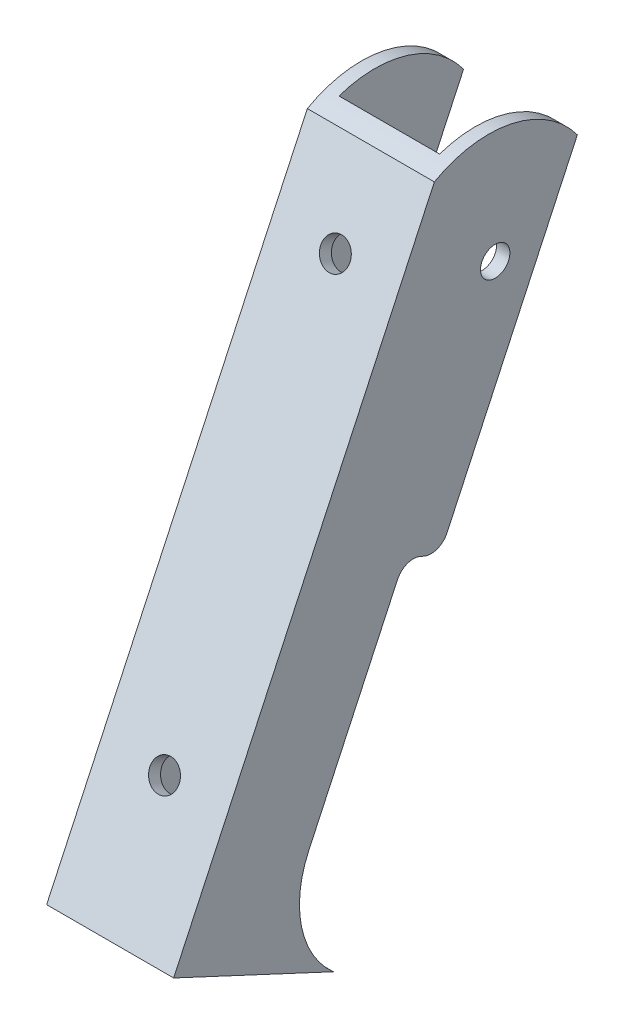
ISO-10303-21;
HEADER;
FILE_DESCRIPTION(('STEP AP214'),'2;1');
FILE_NAME('part.step','',(''),(''),'','','');
FILE_SCHEMA(('AUTOMOTIVE_DESIGN { 1 0 10303 214 1 1 1 1 }'));
ENDSEC;
DATA;
#1=APPLICATION_CONTEXT('core data for automotive mechanical design processes');
#2=APPLICATION_PROTOCOL_DEFINITION('international standard','automotive_design',2000,#1);
#3=PRODUCT_CONTEXT('',#1,'mechanical');
#4=PRODUCT('Part','Part','',(#3));
#5=PRODUCT_RELATED_PRODUCT_CATEGORY('part','',(#4));
#6=PRODUCT_DEFINITION_FORMATION('','',#4);
#7=PRODUCT_DEFINITION_CONTEXT('part definition',#1,'design');
#8=PRODUCT_DEFINITION('design','',#6,#7);
#9=PRODUCT_DEFINITION_SHAPE('','',#8);
#10=(LENGTH_UNIT() NAMED_UNIT(*) SI_UNIT(.MILLI.,.METRE.));
#11=(NAMED_UNIT(*) PLANE_ANGLE_UNIT() SI_UNIT($,.RADIAN.));
#12=(NAMED_UNIT(*) SI_UNIT($,.STERADIAN.) SOLID_ANGLE_UNIT());
#13=UNCERTAINTY_MEASURE_WITH_UNIT(LENGTH_MEASURE(1.E-05),#10,'distance_accuracy_value','');
#14=(GEOMETRIC_REPRESENTATION_CONTEXT(3) GLOBAL_UNCERTAINTY_ASSIGNED_CONTEXT((#13)) GLOBAL_UNIT_ASSIGNED_CONTEXT((#10,
#11,#12)) REPRESENTATION_CONTEXT('',''));
#15=CARTESIAN_POINT('',(0.,0.,0.));
#16=DIRECTION('',(0.,0.,1.));
#17=DIRECTION('',(1.,0.,0.));
#18=AXIS2_PLACEMENT_3D('',#15,#16,#17);
#19=CARTESIAN_POINT('',(1.4224,47.7519999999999,8.25499999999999));
#20=DIRECTION('',(-1.,0.,0.));
#21=DIRECTION('',(0.,0.,1.));
#22=AXIS2_PLACEMENT_3D('',#19,#20,#21);
#23=CYLINDRICAL_SURFACE('',#22,1.27);
#24=CARTESIAN_POINT('',(-8.4074,47.7519999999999,8.25499999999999));
#25=DIRECTION('',(-1.,0.,0.));
#26=DIRECTION('',(0.,0.,1.));
#27=AXIS2_PLACEMENT_3D('',#24,#25,#26);
#28=CIRCLE('',#27,1.27);
#29=CARTESIAN_POINT('',(-8.4074,47.7519999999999,9.52499999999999));
#30=VERTEX_POINT('',#29);
#31=EDGE_CURVE('E311',#30,#30,#28,.F.);
#32=ORIENTED_EDGE('',*,*,#31,.T.);
#33=EDGE_LOOP('',(#32));
#34=FACE_BOUND('',#33,.T.);
#35=CARTESIAN_POINT('',(-9.5504,47.7519999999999,8.25499999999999));
#36=DIRECTION('',(-1.,0.,0.));
#37=DIRECTION('',(0.,0.,1.));
#38=AXIS2_PLACEMENT_3D('',#35,#36,#37);
#39=CIRCLE('',#38,1.27);
#40=CARTESIAN_POINT('',(-9.5504,47.7519999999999,9.52499999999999));
#41=VERTEX_POINT('',#40);
#42=EDGE_CURVE('E21',#41,#41,#39,.F.);
#43=ORIENTED_EDGE('',*,*,#42,.F.);
#44=EDGE_LOOP('',(#43));
#45=FACE_BOUND('',#44,.T.);
#46=ADVANCED_FACE('F17',(#34,#45),#23,.F.);
#47=CARTESIAN_POINT('',(1.4224,27.5025842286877,15.3152647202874));
#48=DIRECTION('',(1.,0.,0.));
#49=DIRECTION('',(0.,0.,-1.));
#50=AXIS2_PLACEMENT_3D('',#47,#48,#49);
#51=CYLINDRICAL_SURFACE('',#50,1.524);
#52=DIRECTION('',(1.,0.,0.));
#53=VECTOR('',#52,1.);
#54=CARTESIAN_POINT('',(1.4224,28.1466544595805,16.6964777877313));
#55=LINE('',#54,#53);
#56=CARTESIAN_POINT('',(-9.5504,28.1466544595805,16.6964777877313));
#57=VERTEX_POINT('',#56);
#58=CARTESIAN_POINT('',(-8.4074,28.1466544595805,16.6964777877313));
#59=VERTEX_POINT('',#58);
#60=EDGE_CURVE('E278',#57,#59,#55,.T.);
#61=ORIENTED_EDGE('',*,*,#60,.F.);
#62=CARTESIAN_POINT('',(-9.5504,27.5025842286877,15.3152647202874));
#63=DIRECTION('',(1.,0.,0.));
#64=DIRECTION('',(0.,0.,-1.));
#65=AXIS2_PLACEMENT_3D('',#62,#63,#64);
#66=CIRCLE('',#65,1.524);
#67=CARTESIAN_POINT('',(-9.5504,28.8837972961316,14.6711944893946));
#68=VERTEX_POINT('',#67);
#69=EDGE_CURVE('E159',#68,#57,#66,.T.);
#70=ORIENTED_EDGE('',*,*,#69,.F.);
#71=DIRECTION('',(1.,0.,0.));
#72=VECTOR('',#71,1.);
#73=CARTESIAN_POINT('',(1.4224,28.8837972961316,14.6711944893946));
#74=LINE('',#73,#72);
#75=CARTESIAN_POINT('',(-8.4074,28.8837972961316,14.6711944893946));
#76=VERTEX_POINT('',#75);
#77=EDGE_CURVE('E154',#76,#68,#74,.F.);
#78=ORIENTED_EDGE('',*,*,#77,.F.);
#79=CARTESIAN_POINT('',(-8.4074,27.5025842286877,15.3152647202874));
#80=DIRECTION('',(1.,0.,0.));
#81=DIRECTION('',(0.,0.,-1.));
#82=AXIS2_PLACEMENT_3D('',#79,#80,#81);
#83=CIRCLE('',#82,1.524);
#84=EDGE_CURVE('E181',#76,#59,#83,.T.);
#85=ORIENTED_EDGE('',*,*,#84,.T.);
#86=EDGE_LOOP('',(#61,#70,#78,#85));
#87=FACE_BOUND('',#86,.T.);
#88=ADVANCED_FACE('F372',(#87),#51,.F.);
#89=CARTESIAN_POINT('',(1.4224,29.5278675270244,16.0524075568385));
#90=DIRECTION('',(0.,-0.422618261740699,-0.90630778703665));
#91=DIRECTION('',(0.,0.90630778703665,-0.422618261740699));
#92=AXIS2_PLACEMENT_3D('',#89,#90,#91);
#93=PLANE('',#92);
#94=DIRECTION('',(0.,-0.90630778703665,0.422618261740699));
#95=VECTOR('',#94,1.);
#96=CARTESIAN_POINT('',(-8.4074,28.1466544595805,16.6964777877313));
#97=LINE('',#96,#95);
#98=CARTESIAN_POINT('',(-8.4074,11.719427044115,24.3566197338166));
#99=VERTEX_POINT('',#98);
#100=EDGE_CURVE('E178',#59,#99,#97,.T.);
#101=ORIENTED_EDGE('',*,*,#100,.T.);
#102=DIRECTION('',(-1.,0.,0.));
#103=VECTOR('',#102,1.);
#104=CARTESIAN_POINT('',(1.4224,11.719427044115,24.3566197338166));
#105=LINE('',#104,#103);
#106=CARTESIAN_POINT('',(-9.5504,11.719427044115,24.3566197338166));
#107=VERTEX_POINT('',#106);
#108=EDGE_CURVE('E275',#99,#107,#105,.T.);
#109=ORIENTED_EDGE('',*,*,#108,.T.);
#110=DIRECTION('',(0.,-0.90630778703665,0.422618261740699));
#111=VECTOR('',#110,1.);
#112=CARTESIAN_POINT('',(-9.5504,28.1466544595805,16.6964777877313));
#113=LINE('',#112,#111);
#114=EDGE_CURVE('E161',#57,#107,#113,.T.);
#115=ORIENTED_EDGE('',*,*,#114,.F.);
#116=ORIENTED_EDGE('',*,*,#60,.T.);
#117=EDGE_LOOP('',(#101,#109,#115,#116));
#118=FACE_BOUND('',#117,.T.);
#119=ADVANCED_FACE('F327',(#118),#93,.T.);
#120=CARTESIAN_POINT('',(1.4224,8.06969573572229,16.5297456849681));
#121=DIRECTION('',(-1.,0.,0.));
#122=DIRECTION('',(0.,0.,1.));
#123=AXIS2_PLACEMENT_3D('',#120,#121,#122);
#124=CYLINDRICAL_SURFACE('',#123,8.636);
#125=DIRECTION('',(-1.,0.,0.));
#126=VECTOR('',#125,1.);
#127=CARTESIAN_POINT('',(1.4224,1.57782141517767,22.2250124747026));
#128=LINE('',#127,#126);
#129=CARTESIAN_POINT('',(-9.5504,1.57782141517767,22.2250124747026));
#130=VERTEX_POINT('',#129);
#131=CARTESIAN_POINT('',(-8.4074,1.57782141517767,22.2250124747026));
#132=VERTEX_POINT('',#131);
#133=EDGE_CURVE('E273',#130,#132,#128,.F.);
#134=ORIENTED_EDGE('',*,*,#133,.F.);
#135=CARTESIAN_POINT('',(-9.5504,8.06969573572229,16.5297456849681));
#136=DIRECTION('',(-1.,0.,0.));
#137=DIRECTION('',(0.,0.,1.));
#138=AXIS2_PLACEMENT_3D('',#135,#136,#137);
#139=CIRCLE('',#138,8.636);
#140=EDGE_CURVE('E320',#107,#130,#139,.F.);
#141=ORIENTED_EDGE('',*,*,#140,.F.);
#142=ORIENTED_EDGE('',*,*,#108,.F.);
#143=CARTESIAN_POINT('',(-8.4074,8.06969573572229,16.5297456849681));
#144=DIRECTION('',(-1.,0.,0.));
#145=DIRECTION('',(0.,0.,1.));
#146=AXIS2_PLACEMENT_3D('',#143,#144,#145);
#147=CIRCLE('',#146,8.636);
#148=EDGE_CURVE('E175',#99,#132,#147,.F.);
#149=ORIENTED_EDGE('',*,*,#148,.T.);
#150=EDGE_LOOP('',(#134,#141,#142,#149));
#151=FACE_BOUND('',#150,.T.);
#152=ADVANCED_FACE('F331',(#151),#124,.F.);
#153=CARTESIAN_POINT('',(1.4224,28.1323820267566,13.0597792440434));
#154=DIRECTION('',(0.,0.422618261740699,0.90630778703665));
#155=DIRECTION('',(0.,-0.90630778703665,0.422618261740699));
#156=AXIS2_PLACEMENT_3D('',#153,#154,#155);
#157=PLANE('',#156);
#158=DIRECTION('',(1.,0.,0.));
#159=VECTOR('',#158,1.);
#160=CARTESIAN_POINT('',(1.4224,29.5135950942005,12.4157090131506));
#161=LINE('',#160,#159);
#162=CARTESIAN_POINT('',(-9.5504,29.5135950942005,12.4157090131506));
#163=VERTEX_POINT('',#162);
#164=CARTESIAN_POINT('',(-8.4074,29.5135950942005,12.4157090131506));
#165=VERTEX_POINT('',#164);
#166=EDGE_CURVE('E155',#163,#165,#161,.T.);
#167=ORIENTED_EDGE('',*,*,#166,.F.);
#168=DIRECTION('',(0.,-0.90630778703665,0.422618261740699));
#169=VECTOR('',#168,1.);
#170=CARTESIAN_POINT('',(-9.5504,53.6612437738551,1.15547550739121));
#171=LINE('',#170,#169);
#172=CARTESIAN_POINT('',(-9.5504,53.6612437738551,1.1554755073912));
#173=VERTEX_POINT('',#172);
#174=EDGE_CURVE('E133',#173,#163,#171,.T.);
#175=ORIENTED_EDGE('',*,*,#174,.F.);
#176=DIRECTION('',(1.,0.,0.));
#177=VECTOR('',#176,1.);
#178=CARTESIAN_POINT('',(1.4224,53.6612437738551,1.15547550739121));
#179=LINE('',#178,#177);
#180=CARTESIAN_POINT('',(-8.4074,53.6612437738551,1.1554755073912));
#181=VERTEX_POINT('',#180);
#182=EDGE_CURVE('E271',#181,#173,#179,.F.);
#183=ORIENTED_EDGE('',*,*,#182,.F.);
#184=DIRECTION('',(0.,-0.90630778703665,0.422618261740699));
#185=VECTOR('',#184,1.);
#186=CARTESIAN_POINT('',(-8.4074,53.6612437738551,1.15547550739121));
#187=LINE('',#186,#185);
#188=EDGE_CURVE('E169',#181,#165,#187,.T.);
#189=ORIENTED_EDGE('',*,*,#188,.T.);
#190=EDGE_LOOP('',(#167,#175,#183,#189));
#191=FACE_BOUND('',#190,.T.);
#192=ADVANCED_FACE('F370',(#191),#157,.F.);
#193=CARTESIAN_POINT('',(1.4224,30.1576653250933,13.7969220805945));
#194=DIRECTION('',(1.,0.,0.));
#195=DIRECTION('',(0.,0.,-1.));
#196=AXIS2_PLACEMENT_3D('',#193,#194,#195);
#197=CYLINDRICAL_SURFACE('',#196,1.524);
#198=CARTESIAN_POINT('',(-9.5504,30.1576653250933,13.7969220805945));
#199=DIRECTION('',(1.,0.,0.));
#200=DIRECTION('',(0.,0.,-1.));
#201=AXIS2_PLACEMENT_3D('',#198,#199,#200);
#202=CIRCLE('',#201,1.524);
#203=CARTESIAN_POINT('',(-9.5504,28.7764522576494,14.4409923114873));
#204=VERTEX_POINT('',#203);
#205=EDGE_CURVE('E137',#163,#204,#202,.F.);
#206=ORIENTED_EDGE('',*,*,#205,.F.);
#207=ORIENTED_EDGE('',*,*,#166,.T.);
#208=CARTESIAN_POINT('',(-8.4074,30.1576653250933,13.7969220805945));
#209=DIRECTION('',(1.,0.,0.));
#210=DIRECTION('',(0.,0.,-1.));
#211=AXIS2_PLACEMENT_3D('',#208,#209,#210);
#212=CIRCLE('',#211,1.524);
#213=CARTESIAN_POINT('',(-8.4074,28.7764522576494,14.4409923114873));
#214=VERTEX_POINT('',#213);
#215=EDGE_CURVE('E150',#165,#214,#212,.F.);
#216=ORIENTED_EDGE('',*,*,#215,.T.);
#217=DIRECTION('',(1.,0.,0.));
#218=VECTOR('',#217,1.);
#219=CARTESIAN_POINT('',(1.4224,28.7764522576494,14.4409923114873));
#220=LINE('',#219,#218);
#221=EDGE_CURVE('E147',#204,#214,#220,.T.);
#222=ORIENTED_EDGE('',*,*,#221,.F.);
#223=EDGE_LOOP('',(#206,#207,#216,#222));
#224=FACE_BOUND('',#223,.T.);
#225=ADVANCED_FACE('F148',(#224),#197,.T.);
#226=CARTESIAN_POINT('',(1.4224,27.4614755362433,11.6210156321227));
#227=DIRECTION('',(0.,-0.90630778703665,0.422618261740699));
#228=DIRECTION('',(0.,-0.422618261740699,-0.90630778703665));
#229=AXIS2_PLACEMENT_3D('',#226,#227,#228);
#230=PLANE('',#229);
#231=DIRECTION('',(0.,0.422618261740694,0.906307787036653));
#232=VECTOR('',#231,1.);
#233=CARTESIAN_POINT('',(-8.4074,28.7764522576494,14.4409923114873));
#234=LINE('',#233,#232);
#235=EDGE_CURVE('E166',#214,#76,#234,.T.);
#236=ORIENTED_EDGE('',*,*,#235,.T.);
#237=ORIENTED_EDGE('',*,*,#77,.T.);
#238=DIRECTION('',(0.,0.422618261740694,0.906307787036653));
#239=VECTOR('',#238,1.);
#240=CARTESIAN_POINT('',(-9.5504,28.7764522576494,14.4409923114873));
#241=LINE('',#240,#239);
#242=EDGE_CURVE('E143',#204,#68,#241,.T.);
#243=ORIENTED_EDGE('',*,*,#242,.F.);
#244=ORIENTED_EDGE('',*,*,#221,.T.);
#245=EDGE_LOOP('',(#236,#237,#243,#244));
#246=FACE_BOUND('',#245,.T.);
#247=ADVANCED_FACE('F157',(#246),#230,.T.);
#248=CARTESIAN_POINT('',(-4.064,49.7405215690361,16.5762508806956));
#249=DIRECTION('',(0.,-0.422618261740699,-0.90630778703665));
#250=DIRECTION('',(0.,0.90630778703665,-0.422618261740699));
#251=AXIS2_PLACEMENT_3D('',#248,#249,#250);
#252=CYLINDRICAL_SURFACE('',#251,1.27);
#253=CARTESIAN_POINT('',(-4.064,49.7405215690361,16.5762508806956));
#254=DIRECTION('',(0.,-0.422618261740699,-0.90630778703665));
#255=DIRECTION('',(0.,0.90630778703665,-0.422618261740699));
#256=AXIS2_PLACEMENT_3D('',#253,#254,#255);
#257=CIRCLE('',#256,1.27);
#258=CARTESIAN_POINT('',(-4.064,50.8915324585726,16.0395256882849));
#259=VERTEX_POINT('',#258);
#260=EDGE_CURVE('E251',#259,#259,#257,.F.);
#261=ORIENTED_EDGE('',*,*,#260,.T.);
#262=EDGE_LOOP('',(#261));
#263=FACE_BOUND('',#262,.T.);
#264=CARTESIAN_POINT('',(-4.064,49.2574688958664,15.5403410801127));
#265=DIRECTION('',(0.,-0.422618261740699,-0.90630778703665));
#266=DIRECTION('',(0.,0.90630778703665,-0.422618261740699));
#267=AXIS2_PLACEMENT_3D('',#264,#265,#266);
#268=CIRCLE('',#267,1.27);
#269=CARTESIAN_POINT('',(-4.064,50.408479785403,15.003615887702));
#270=VERTEX_POINT('',#269);
#271=EDGE_CURVE('E317',#270,#270,#268,.F.);
#272=ORIENTED_EDGE('',*,*,#271,.F.);
#273=EDGE_LOOP('',(#272));
#274=FACE_BOUND('',#273,.T.);
#275=ADVANCED_FACE('F434',(#263,#274),#252,.F.);
#276=CARTESIAN_POINT('',(-4.064,18.0877221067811,31.3361936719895));
#277=DIRECTION('',(0.,-0.422618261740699,-0.90630778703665));
#278=DIRECTION('',(0.,0.90630778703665,-0.422618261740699));
#279=AXIS2_PLACEMENT_3D('',#276,#277,#278);
#280=CYLINDRICAL_SURFACE('',#279,1.27);
#281=CARTESIAN_POINT('',(-4.064,18.0877221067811,31.3361936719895));
#282=DIRECTION('',(0.,-0.422618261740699,-0.90630778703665));
#283=DIRECTION('',(0.,0.90630778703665,-0.422618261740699));
#284=AXIS2_PLACEMENT_3D('',#281,#282,#283);
#285=CIRCLE('',#284,1.27);
#286=CARTESIAN_POINT('',(-4.064,19.2387329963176,30.7994684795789));
#287=VERTEX_POINT('',#286);
#288=EDGE_CURVE('E228',#287,#287,#285,.F.);
#289=ORIENTED_EDGE('',*,*,#288,.T.);
#290=EDGE_LOOP('',(#289));
#291=FACE_BOUND('',#290,.T.);
#292=CARTESIAN_POINT('',(-4.064,17.6046694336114,30.3002838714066));
#293=DIRECTION('',(0.,-0.422618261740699,-0.90630778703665));
#294=DIRECTION('',(0.,0.90630778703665,-0.422618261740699));
#295=AXIS2_PLACEMENT_3D('',#292,#293,#294);
#296=CIRCLE('',#295,1.27);
#297=CARTESIAN_POINT('',(-4.064,18.755680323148,29.763558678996));
#298=VERTEX_POINT('',#297);
#299=EDGE_CURVE('E314',#298,#298,#296,.F.);
#300=ORIENTED_EDGE('',*,*,#299,.F.);
#301=EDGE_LOOP('',(#300));
#302=FACE_BOUND('',#301,.T.);
#303=ADVANCED_FACE('F431',(#291,#302),#280,.F.);
#304=CARTESIAN_POINT('',(-9.5504,8.06969573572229,16.5297456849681));
#305=DIRECTION('',(-1.,0.,0.));
#306=DIRECTION('',(0.,0.,1.));
#307=AXIS2_PLACEMENT_3D('',#304,#305,#306);
#308=PLANE('',#307);
#309=DIRECTION('',(0.,0.90630778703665,-0.422618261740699));
#310=VECTOR('',#309,1.);
#311=CARTESIAN_POINT('',(-9.5504,56.3168048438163,13.5096796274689));
#312=LINE('',#311,#310);
#313=CARTESIAN_POINT('',(-9.5504,8.01637682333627,36.0325391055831));
#314=VERTEX_POINT('',#313);
#315=CARTESIAN_POINT('',(-9.5504,56.3168048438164,13.5096796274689));
#316=VERTEX_POINT('',#315);
#317=EDGE_CURVE('E227',#314,#316,#312,.T.);
#318=ORIENTED_EDGE('',*,*,#317,.T.);
#319=CARTESIAN_POINT('',(-9.5504,48.0203625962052,8.83050544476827));
#320=DIRECTION('',(-1.,0.,0.));
#321=DIRECTION('',(0.,0.,1.));
#322=AXIS2_PLACEMENT_3D('',#319,#320,#321);
#323=CIRCLE('',#322,9.525);
#324=EDGE_CURVE('E223',#173,#316,#323,.F.);
#325=ORIENTED_EDGE('',*,*,#324,.F.);
#326=ORIENTED_EDGE('',*,*,#174,.T.);
#327=ORIENTED_EDGE('',*,*,#205,.T.);
#328=ORIENTED_EDGE('',*,*,#242,.T.);
#329=ORIENTED_EDGE('',*,*,#69,.T.);
#330=ORIENTED_EDGE('',*,*,#114,.T.);
#331=ORIENTED_EDGE('',*,*,#140,.T.);
#332=DIRECTION('',(0.,-0.422618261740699,-0.90630778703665));
#333=VECTOR('',#332,1.);
#334=CARTESIAN_POINT('',(-9.5504,1.57782141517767,22.2250124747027));
#335=LINE('',#334,#333);
#336=EDGE_CURVE('E233',#314,#130,#335,.T.);
#337=ORIENTED_EDGE('',*,*,#336,.F.);
#338=EDGE_LOOP('',(#318,#325,#326,#327,#328,#329,#330,#331,#337));
#339=FACE_BOUND('',#338,.T.);
#340=ORIENTED_EDGE('',*,*,#42,.T.);
#341=EDGE_LOOP('',(#340));
#342=FACE_BOUND('',#341,.T.);
#343=ADVANCED_FACE('F140',(#339,#342),#308,.T.);
#344=CARTESIAN_POINT('',(1.4224,55.8337521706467,12.4737698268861));
#345=DIRECTION('',(0.,-0.422618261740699,-0.90630778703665));
#346=DIRECTION('',(0.,0.90630778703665,-0.422618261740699));
#347=AXIS2_PLACEMENT_3D('',#344,#345,#346);
#348=PLANE('',#347);
#349=DIRECTION('',(1.,0.,0.));
#350=VECTOR('',#349,1.);
#351=CARTESIAN_POINT('',(1.4224,7.53332415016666,34.9966293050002));
#352=LINE('',#351,#350);
#353=CARTESIAN_POINT('',(-8.4074,7.53332415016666,34.9966293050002));
#354=VERTEX_POINT('',#353);
#355=CARTESIAN_POINT('',(0.2794,7.53332415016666,34.9966293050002));
#356=VERTEX_POINT('',#355);
#357=EDGE_CURVE('E255',#354,#356,#352,.T.);
#358=ORIENTED_EDGE('',*,*,#357,.F.);
#359=DIRECTION('',(0.,0.90630778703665,-0.422618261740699));
#360=VECTOR('',#359,1.);
#361=CARTESIAN_POINT('',(-8.4074,7.53332415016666,34.9966293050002));
#362=LINE('',#361,#360);
#363=CARTESIAN_POINT('',(-8.4074,57.0321188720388,11.914962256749));
#364=VERTEX_POINT('',#363);
#365=EDGE_CURVE('E172',#354,#364,#362,.T.);
#366=ORIENTED_EDGE('',*,*,#365,.T.);
#367=DIRECTION('',(-1.,0.,0.));
#368=VECTOR('',#367,1.);
#369=CARTESIAN_POINT('',(1.4224,57.0321188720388,11.914962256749));
#370=LINE('',#369,#368);
#371=CARTESIAN_POINT('',(0.2794,57.0321188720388,11.914962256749));
#372=VERTEX_POINT('',#371);
#373=EDGE_CURVE('E244',#372,#364,#370,.T.);
#374=ORIENTED_EDGE('',*,*,#373,.F.);
#375=DIRECTION('',(0.,0.90630778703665,-0.422618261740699));
#376=VECTOR('',#375,1.);
#377=CARTESIAN_POINT('',(0.2794,7.53332415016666,34.9966293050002));
#378=LINE('',#377,#376);
#379=EDGE_CURVE('E182',#356,#372,#378,.T.);
#380=ORIENTED_EDGE('',*,*,#379,.F.);
#381=EDGE_LOOP('',(#358,#366,#374,#380));
#382=FACE_BOUND('',#381,.T.);
#383=ORIENTED_EDGE('',*,*,#299,.T.);
#384=EDGE_LOOP('',(#383));
#385=FACE_BOUND('',#384,.T.);
#386=ORIENTED_EDGE('',*,*,#271,.T.);
#387=EDGE_LOOP('',(#386));
#388=FACE_BOUND('',#387,.T.);
#389=ADVANCED_FACE('F360',(#382,#385,#388),#348,.T.);
#390=CARTESIAN_POINT('',(-8.4074,8.06969573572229,16.5297456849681));
#391=DIRECTION('',(-1.,0.,0.));
#392=DIRECTION('',(0.,0.,1.));
#393=AXIS2_PLACEMENT_3D('',#390,#391,#392);
#394=PLANE('',#393);
#395=ORIENTED_EDGE('',*,*,#215,.F.);
#396=ORIENTED_EDGE('',*,*,#188,.F.);
#397=CARTESIAN_POINT('',(-8.4074,48.0203625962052,8.83050544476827));
#398=DIRECTION('',(-1.,0.,0.));
#399=DIRECTION('',(0.,0.,1.));
#400=AXIS2_PLACEMENT_3D('',#397,#398,#399);
#401=CIRCLE('',#400,9.525);
#402=EDGE_CURVE('E219',#364,#181,#401,.T.);
#403=ORIENTED_EDGE('',*,*,#402,.F.);
#404=ORIENTED_EDGE('',*,*,#365,.F.);
#405=DIRECTION('',(0.,-0.422618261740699,-0.90630778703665));
#406=VECTOR('',#405,1.);
#407=CARTESIAN_POINT('',(-8.4074,1.57782141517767,22.2250124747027));
#408=LINE('',#407,#406);
#409=EDGE_CURVE('E260',#132,#354,#408,.F.);
#410=ORIENTED_EDGE('',*,*,#409,.F.);
#411=ORIENTED_EDGE('',*,*,#148,.F.);
#412=ORIENTED_EDGE('',*,*,#100,.F.);
#413=ORIENTED_EDGE('',*,*,#84,.F.);
#414=ORIENTED_EDGE('',*,*,#235,.F.);
#415=EDGE_LOOP('',(#395,#396,#403,#404,#410,#411,#412,#413,#414));
#416=FACE_BOUND('',#415,.T.);
#417=ORIENTED_EDGE('',*,*,#31,.F.);
#418=EDGE_LOOP('',(#417));
#419=FACE_BOUND('',#418,.T.);
#420=ADVANCED_FACE('F367',(#416,#419),#394,.F.);
#421=CARTESIAN_POINT('',(0.2794,8.06969573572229,16.5297456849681));
#422=DIRECTION('',(-1.,0.,0.));
#423=DIRECTION('',(0.,0.,1.));
#424=AXIS2_PLACEMENT_3D('',#421,#422,#423);
#425=PLANE('',#424);
#426=ORIENTED_EDGE('',*,*,#379,.T.);
#427=CARTESIAN_POINT('',(0.2794,48.0203625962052,8.83050544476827));
#428=DIRECTION('',(-1.,0.,0.));
#429=DIRECTION('',(0.,0.,1.));
#430=AXIS2_PLACEMENT_3D('',#427,#428,#429);
#431=CIRCLE('',#430,9.525);
#432=CARTESIAN_POINT('',(0.2794,53.6612437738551,1.1554755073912));
#433=VERTEX_POINT('',#432);
#434=EDGE_CURVE('E222',#433,#372,#431,.F.);
#435=ORIENTED_EDGE('',*,*,#434,.F.);
#436=DIRECTION('',(0.,-0.90630778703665,0.422618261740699));
#437=VECTOR('',#436,1.);
#438=CARTESIAN_POINT('',(0.2794,28.1323820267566,13.0597792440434));
#439=LINE('',#438,#437);
#440=CARTESIAN_POINT('',(0.2794,29.5135950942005,12.4157090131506));
#441=VERTEX_POINT('',#440);
#442=EDGE_CURVE('E218',#433,#441,#439,.T.);
#443=ORIENTED_EDGE('',*,*,#442,.T.);
#444=CARTESIAN_POINT('',(0.2794,30.1576653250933,13.7969220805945));
#445=DIRECTION('',(1.,0.,0.));
#446=DIRECTION('',(0.,0.,-1.));
#447=AXIS2_PLACEMENT_3D('',#444,#445,#446);
#448=CIRCLE('',#447,1.524);
#449=CARTESIAN_POINT('',(0.2794,28.7764522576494,14.4409923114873));
#450=VERTEX_POINT('',#449);
#451=EDGE_CURVE('E214',#450,#441,#448,.T.);
#452=ORIENTED_EDGE('',*,*,#451,.F.);
#453=DIRECTION('',(0.,0.422618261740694,0.906307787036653));
#454=VECTOR('',#453,1.);
#455=CARTESIAN_POINT('',(0.2794,28.7764522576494,14.4409923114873));
#456=LINE('',#455,#454);
#457=CARTESIAN_POINT('',(0.2794,28.8837972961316,14.6711944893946));
#458=VERTEX_POINT('',#457);
#459=EDGE_CURVE('E168',#450,#458,#456,.T.);
#460=ORIENTED_EDGE('',*,*,#459,.T.);
#461=CARTESIAN_POINT('',(0.2794,27.5025842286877,15.3152647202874));
#462=DIRECTION('',(1.,0.,0.));
#463=DIRECTION('',(0.,0.,-1.));
#464=AXIS2_PLACEMENT_3D('',#461,#462,#463);
#465=CIRCLE('',#464,1.524);
#466=CARTESIAN_POINT('',(0.2794,28.1466544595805,16.6964777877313));
#467=VERTEX_POINT('',#466);
#468=EDGE_CURVE('E267',#458,#467,#465,.T.);
#469=ORIENTED_EDGE('',*,*,#468,.T.);
#470=DIRECTION('',(0.,0.90630778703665,-0.422618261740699));
#471=VECTOR('',#470,1.);
#472=CARTESIAN_POINT('',(0.2794,29.5278675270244,16.0524075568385));
#473=LINE('',#472,#471);
#474=CARTESIAN_POINT('',(0.2794,11.719427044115,24.3566197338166));
#475=VERTEX_POINT('',#474);
#476=EDGE_CURVE('E241',#475,#467,#473,.T.);
#477=ORIENTED_EDGE('',*,*,#476,.F.);
#478=CARTESIAN_POINT('',(0.2794,8.06969573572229,16.5297456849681));
#479=DIRECTION('',(-1.,0.,0.));
#480=DIRECTION('',(0.,0.,1.));
#481=AXIS2_PLACEMENT_3D('',#478,#479,#480);
#482=CIRCLE('',#481,8.636);
#483=CARTESIAN_POINT('',(0.2794,1.57782141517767,22.2250124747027));
#484=VERTEX_POINT('',#483);
#485=EDGE_CURVE('E238',#475,#484,#482,.F.);
#486=ORIENTED_EDGE('',*,*,#485,.T.);
#487=DIRECTION('',(0.,-0.422618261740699,-0.90630778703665));
#488=VECTOR('',#487,1.);
#489=CARTESIAN_POINT('',(0.2794,1.57782141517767,22.2250124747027));
#490=LINE('',#489,#488);
#491=EDGE_CURVE('E234',#356,#484,#490,.T.);
#492=ORIENTED_EDGE('',*,*,#491,.F.);
#493=EDGE_LOOP('',(#426,#435,#443,#452,#460,#469,#477,#486,#492));
#494=FACE_BOUND('',#493,.T.);
#495=CARTESIAN_POINT('',(0.2794,47.7519999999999,8.25499999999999));
#496=DIRECTION('',(-1.,0.,0.));
#497=DIRECTION('',(0.,0.,1.));
#498=AXIS2_PLACEMENT_3D('',#495,#496,#497);
#499=CIRCLE('',#498,1.27);
#500=CARTESIAN_POINT('',(0.2794,47.7519999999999,9.52499999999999));
#501=VERTEX_POINT('',#500);
#502=EDGE_CURVE('E184',#501,#501,#499,.F.);
#503=ORIENTED_EDGE('',*,*,#502,.T.);
#504=EDGE_LOOP('',(#503));
#505=FACE_BOUND('',#504,.T.);
#506=ADVANCED_FACE('F421',(#494,#505),#425,.T.);
#507=CARTESIAN_POINT('',(1.4224,47.7519999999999,8.25499999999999));
#508=DIRECTION('',(-1.,0.,0.));
#509=DIRECTION('',(0.,0.,1.));
#510=AXIS2_PLACEMENT_3D('',#507,#508,#509);
#511=CYLINDRICAL_SURFACE('',#510,1.27);
#512=CARTESIAN_POINT('',(1.4224,47.7519999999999,8.25499999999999));
#513=DIRECTION('',(-1.,0.,0.));
#514=DIRECTION('',(0.,0.,1.));
#515=AXIS2_PLACEMENT_3D('',#512,#513,#514);
#516=CIRCLE('',#515,1.27);
#517=CARTESIAN_POINT('',(1.4224,47.7519999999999,9.52499999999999));
#518=VERTEX_POINT('',#517);
#519=EDGE_CURVE('E212',#518,#518,#516,.F.);
#520=ORIENTED_EDGE('',*,*,#519,.T.);
#521=EDGE_LOOP('',(#520));
#522=FACE_BOUND('',#521,.T.);
#523=ORIENTED_EDGE('',*,*,#502,.F.);
#524=EDGE_LOOP('',(#523));
#525=FACE_BOUND('',#524,.T.);
#526=ADVANCED_FACE('F417',(#522,#525),#511,.F.);
#527=CARTESIAN_POINT('',(1.4224,27.5025842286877,15.3152647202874));
#528=DIRECTION('',(1.,0.,0.));
#529=DIRECTION('',(0.,0.,-1.));
#530=AXIS2_PLACEMENT_3D('',#527,#528,#529);
#531=CYLINDRICAL_SURFACE('',#530,1.524);
#532=DIRECTION('',(1.,0.,0.));
#533=VECTOR('',#532,1.);
#534=CARTESIAN_POINT('',(1.4224,28.1466544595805,16.6964777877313));
#535=LINE('',#534,#533);
#536=CARTESIAN_POINT('',(1.4224,28.1466544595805,16.6964777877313));
#537=VERTEX_POINT('',#536);
#538=EDGE_CURVE('E239',#467,#537,#535,.T.);
#539=ORIENTED_EDGE('',*,*,#538,.F.);
#540=ORIENTED_EDGE('',*,*,#468,.F.);
#541=DIRECTION('',(1.,0.,0.));
#542=VECTOR('',#541,1.);
#543=CARTESIAN_POINT('',(1.4224,28.8837972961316,14.6711944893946));
#544=LINE('',#543,#542);
#545=CARTESIAN_POINT('',(1.4224,28.8837972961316,14.6711944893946));
#546=VERTEX_POINT('',#545);
#547=EDGE_CURVE('E208',#546,#458,#544,.F.);
#548=ORIENTED_EDGE('',*,*,#547,.F.);
#549=CARTESIAN_POINT('',(1.4224,27.5025842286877,15.3152647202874));
#550=DIRECTION('',(1.,0.,0.));
#551=DIRECTION('',(0.,0.,-1.));
#552=AXIS2_PLACEMENT_3D('',#549,#550,#551);
#553=CIRCLE('',#552,1.524);
#554=EDGE_CURVE('E206',#546,#537,#553,.T.);
#555=ORIENTED_EDGE('',*,*,#554,.T.);
#556=EDGE_LOOP('',(#539,#540,#548,#555));
#557=FACE_BOUND('',#556,.T.);
#558=ADVANCED_FACE('F413',(#557),#531,.F.);
#559=CARTESIAN_POINT('',(1.4224,29.5278675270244,16.0524075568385));
#560=DIRECTION('',(0.,-0.422618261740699,-0.90630778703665));
#561=DIRECTION('',(0.,0.90630778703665,-0.422618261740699));
#562=AXIS2_PLACEMENT_3D('',#559,#560,#561);
#563=PLANE('',#562);
#564=DIRECTION('',(0.,-0.90630778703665,0.422618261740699));
#565=VECTOR('',#564,1.);
#566=CARTESIAN_POINT('',(1.4224,28.1466544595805,16.6964777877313));
#567=LINE('',#566,#565);
#568=CARTESIAN_POINT('',(1.4224,11.719427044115,24.3566197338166));
#569=VERTEX_POINT('',#568);
#570=EDGE_CURVE('E203',#537,#569,#567,.T.);
#571=ORIENTED_EDGE('',*,*,#570,.T.);
#572=DIRECTION('',(-1.,0.,0.));
#573=VECTOR('',#572,1.);
#574=CARTESIAN_POINT('',(1.4224,11.719427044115,24.3566197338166));
#575=LINE('',#574,#573);
#576=EDGE_CURVE('E235',#569,#475,#575,.T.);
#577=ORIENTED_EDGE('',*,*,#576,.T.);
#578=ORIENTED_EDGE('',*,*,#476,.T.);
#579=ORIENTED_EDGE('',*,*,#538,.T.);
#580=EDGE_LOOP('',(#571,#577,#578,#579));
#581=FACE_BOUND('',#580,.T.);
#582=ADVANCED_FACE('F409',(#581),#563,.T.);
#583=CARTESIAN_POINT('',(1.4224,8.06969573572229,16.5297456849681));
#584=DIRECTION('',(-1.,0.,0.));
#585=DIRECTION('',(0.,0.,1.));
#586=AXIS2_PLACEMENT_3D('',#583,#584,#585);
#587=CYLINDRICAL_SURFACE('',#586,8.636);
#588=ORIENTED_EDGE('',*,*,#485,.F.);
#589=ORIENTED_EDGE('',*,*,#576,.F.);
#590=CARTESIAN_POINT('',(1.4224,8.06969573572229,16.5297456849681));
#591=DIRECTION('',(-1.,0.,0.));
#592=DIRECTION('',(0.,0.,1.));
#593=AXIS2_PLACEMENT_3D('',#590,#591,#592);
#594=CIRCLE('',#593,8.636);
#595=CARTESIAN_POINT('',(1.4224,1.57782141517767,22.2250124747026));
#596=VERTEX_POINT('',#595);
#597=EDGE_CURVE('E200',#569,#596,#594,.F.);
#598=ORIENTED_EDGE('',*,*,#597,.T.);
#599=DIRECTION('',(1.,0.,0.));
#600=VECTOR('',#599,1.);
#601=CARTESIAN_POINT('',(1.4224,1.57782141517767,22.2250124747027));
#602=LINE('',#601,#600);
#603=EDGE_CURVE('E231',#484,#596,#602,.T.);
#604=ORIENTED_EDGE('',*,*,#603,.F.);
#605=EDGE_LOOP('',(#588,#589,#598,#604));
#606=FACE_BOUND('',#605,.T.);
#607=ADVANCED_FACE('F406',(#606),#587,.F.);
#608=CARTESIAN_POINT('',(1.4224,1.57782141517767,22.2250124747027));
#609=DIRECTION('',(0.,-0.90630778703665,0.422618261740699));
#610=DIRECTION('',(0.,-0.422618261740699,-0.90630778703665));
#611=AXIS2_PLACEMENT_3D('',#608,#609,#610);
#612=PLANE('',#611);
#613=DIRECTION('',(1.,0.,0.));
#614=VECTOR('',#613,1.);
#615=CARTESIAN_POINT('',(1.4224,8.01637682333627,36.0325391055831));
#616=LINE('',#615,#614);
#617=CARTESIAN_POINT('',(1.4224,8.01637682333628,36.0325391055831));
#618=VERTEX_POINT('',#617);
#619=EDGE_CURVE('E224',#618,#314,#616,.F.);
#620=ORIENTED_EDGE('',*,*,#619,.T.);
#621=ORIENTED_EDGE('',*,*,#336,.T.);
#622=ORIENTED_EDGE('',*,*,#133,.T.);
#623=ORIENTED_EDGE('',*,*,#409,.T.);
#624=ORIENTED_EDGE('',*,*,#357,.T.);
#625=ORIENTED_EDGE('',*,*,#491,.T.);
#626=ORIENTED_EDGE('',*,*,#603,.T.);
#627=DIRECTION('',(0.,0.422618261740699,0.90630778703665));
#628=VECTOR('',#627,1.);
#629=CARTESIAN_POINT('',(1.4224,1.57782141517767,22.2250124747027));
#630=LINE('',#629,#628);
#631=EDGE_CURVE('E195',#596,#618,#630,.T.);
#632=ORIENTED_EDGE('',*,*,#631,.T.);
#633=EDGE_LOOP('',(#620,#621,#622,#623,#624,#625,#626,#632));
#634=FACE_BOUND('',#633,.T.);
#635=ADVANCED_FACE('F334',(#634),#612,.T.);
#636=CARTESIAN_POINT('',(1.4224,56.3168048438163,13.5096796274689));
#637=DIRECTION('',(0.,-0.422618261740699,-0.90630778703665));
#638=DIRECTION('',(0.,0.90630778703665,-0.422618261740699));
#639=AXIS2_PLACEMENT_3D('',#636,#637,#638);
#640=PLANE('',#639);
#641=ORIENTED_EDGE('',*,*,#317,.F.);
#642=ORIENTED_EDGE('',*,*,#619,.F.);
#643=DIRECTION('',(0.,0.90630778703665,-0.422618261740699));
#644=VECTOR('',#643,1.);
#645=CARTESIAN_POINT('',(1.4224,8.01637682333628,36.0325391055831));
#646=LINE('',#645,#644);
#647=CARTESIAN_POINT('',(1.4224,56.3168048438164,13.5096796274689));
#648=VERTEX_POINT('',#647);
#649=EDGE_CURVE('E192',#618,#648,#646,.T.);
#650=ORIENTED_EDGE('',*,*,#649,.T.);
#651=DIRECTION('',(-1.,0.,0.));
#652=VECTOR('',#651,1.);
#653=CARTESIAN_POINT('',(1.4224,56.3168048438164,13.509679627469));
#654=LINE('',#653,#652);
#655=EDGE_CURVE('E220',#316,#648,#654,.F.);
#656=ORIENTED_EDGE('',*,*,#655,.F.);
#657=EDGE_LOOP('',(#641,#642,#650,#656));
#658=FACE_BOUND('',#657,.T.);
#659=ORIENTED_EDGE('',*,*,#288,.F.);
#660=EDGE_LOOP('',(#659));
#661=FACE_BOUND('',#660,.T.);
#662=ORIENTED_EDGE('',*,*,#260,.F.);
#663=EDGE_LOOP('',(#662));
#664=FACE_BOUND('',#663,.T.);
#665=ADVANCED_FACE('F341',(#658,#661,#664),#640,.F.);
#666=CARTESIAN_POINT('',(1.4224,48.0203625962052,8.83050544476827));
#667=DIRECTION('',(-1.,0.,0.));
#668=DIRECTION('',(0.,0.,1.));
#669=AXIS2_PLACEMENT_3D('',#666,#667,#668);
#670=CYLINDRICAL_SURFACE('',#669,9.525);
#671=ORIENTED_EDGE('',*,*,#373,.T.);
#672=ORIENTED_EDGE('',*,*,#402,.T.);
#673=ORIENTED_EDGE('',*,*,#182,.T.);
#674=ORIENTED_EDGE('',*,*,#324,.T.);
#675=ORIENTED_EDGE('',*,*,#655,.T.);
#676=CARTESIAN_POINT('',(1.4224,48.0203625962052,8.83050544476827));
#677=DIRECTION('',(-1.,0.,0.));
#678=DIRECTION('',(0.,0.,1.));
#679=AXIS2_PLACEMENT_3D('',#676,#677,#678);
#680=CIRCLE('',#679,9.525);
#681=CARTESIAN_POINT('',(1.4224,53.6612437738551,1.1554755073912));
#682=VERTEX_POINT('',#681);
#683=EDGE_CURVE('E191',#648,#682,#680,.T.);
#684=ORIENTED_EDGE('',*,*,#683,.T.);
#685=DIRECTION('',(1.,0.,0.));
#686=VECTOR('',#685,1.);
#687=CARTESIAN_POINT('',(1.4224,53.6612437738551,1.15547550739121));
#688=LINE('',#687,#686);
#689=EDGE_CURVE('E215',#682,#433,#688,.F.);
#690=ORIENTED_EDGE('',*,*,#689,.T.);
#691=ORIENTED_EDGE('',*,*,#434,.T.);
#692=EDGE_LOOP('',(#671,#672,#673,#674,#675,#684,#690,#691));
#693=FACE_BOUND('',#692,.T.);
#694=ADVANCED_FACE('F346',(#693),#670,.T.);
#695=CARTESIAN_POINT('',(1.4224,28.1323820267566,13.0597792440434));
#696=DIRECTION('',(0.,0.422618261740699,0.90630778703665));
#697=DIRECTION('',(0.,-0.90630778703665,0.422618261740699));
#698=AXIS2_PLACEMENT_3D('',#695,#696,#697);
#699=PLANE('',#698);
#700=DIRECTION('',(1.,0.,0.));
#701=VECTOR('',#700,1.);
#702=CARTESIAN_POINT('',(1.4224,29.5135950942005,12.4157090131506));
#703=LINE('',#702,#701);
#704=CARTESIAN_POINT('',(1.4224,29.5135950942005,12.4157090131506));
#705=VERTEX_POINT('',#704);
#706=EDGE_CURVE('E209',#441,#705,#703,.T.);
#707=ORIENTED_EDGE('',*,*,#706,.F.);
#708=ORIENTED_EDGE('',*,*,#442,.F.);
#709=ORIENTED_EDGE('',*,*,#689,.F.);
#710=DIRECTION('',(0.,-0.90630778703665,0.422618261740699));
#711=VECTOR('',#710,1.);
#712=CARTESIAN_POINT('',(1.4224,53.6612437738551,1.15547550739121));
#713=LINE('',#712,#711);
#714=EDGE_CURVE('E188',#682,#705,#713,.T.);
#715=ORIENTED_EDGE('',*,*,#714,.T.);
#716=EDGE_LOOP('',(#707,#708,#709,#715));
#717=FACE_BOUND('',#716,.T.);
#718=ADVANCED_FACE('F354',(#717),#699,.F.);
#719=CARTESIAN_POINT('',(1.4224,30.1576653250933,13.7969220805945));
#720=DIRECTION('',(1.,0.,0.));
#721=DIRECTION('',(0.,0.,-1.));
#722=AXIS2_PLACEMENT_3D('',#719,#720,#721);
#723=CYLINDRICAL_SURFACE('',#722,1.524);
#724=ORIENTED_EDGE('',*,*,#451,.T.);
#725=ORIENTED_EDGE('',*,*,#706,.T.);
#726=CARTESIAN_POINT('',(1.4224,30.1576653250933,13.7969220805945));
#727=DIRECTION('',(1.,0.,0.));
#728=DIRECTION('',(0.,0.,-1.));
#729=AXIS2_PLACEMENT_3D('',#726,#727,#728);
#730=CIRCLE('',#729,1.524);
#731=CARTESIAN_POINT('',(1.4224,28.7764522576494,14.4409923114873));
#732=VERTEX_POINT('',#731);
#733=EDGE_CURVE('E27',#705,#732,#730,.F.);
#734=ORIENTED_EDGE('',*,*,#733,.T.);
#735=DIRECTION('',(1.,0.,0.));
#736=VECTOR('',#735,1.);
#737=CARTESIAN_POINT('',(1.4224,28.7764522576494,14.4409923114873));
#738=LINE('',#737,#736);
#739=EDGE_CURVE('E35',#450,#732,#738,.T.);
#740=ORIENTED_EDGE('',*,*,#739,.F.);
#741=EDGE_LOOP('',(#724,#725,#734,#740));
#742=FACE_BOUND('',#741,.T.);
#743=ADVANCED_FACE('F390',(#742),#723,.T.);
#744=CARTESIAN_POINT('',(1.4224,27.4614755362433,11.6210156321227));
#745=DIRECTION('',(0.,-0.90630778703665,0.422618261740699));
#746=DIRECTION('',(0.,-0.422618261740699,-0.90630778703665));
#747=AXIS2_PLACEMENT_3D('',#744,#745,#746);
#748=PLANE('',#747);
#749=DIRECTION('',(0.,0.422618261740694,0.906307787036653));
#750=VECTOR('',#749,1.);
#751=CARTESIAN_POINT('',(1.4224,28.7764522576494,14.4409923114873));
#752=LINE('',#751,#750);
#753=EDGE_CURVE('E11',#732,#546,#752,.T.);
#754=ORIENTED_EDGE('',*,*,#753,.T.);
#755=ORIENTED_EDGE('',*,*,#547,.T.);
#756=ORIENTED_EDGE('',*,*,#459,.F.);
#757=ORIENTED_EDGE('',*,*,#739,.T.);
#758=EDGE_LOOP('',(#754,#755,#756,#757));
#759=FACE_BOUND('',#758,.T.);
#760=ADVANCED_FACE('F385',(#759),#748,.T.);
#761=CARTESIAN_POINT('',(1.4224,8.06969573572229,16.5297456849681));
#762=DIRECTION('',(-1.,0.,0.));
#763=DIRECTION('',(0.,0.,1.));
#764=AXIS2_PLACEMENT_3D('',#761,#762,#763);
#765=PLANE('',#764);
#766=ORIENTED_EDGE('',*,*,#733,.F.);
#767=ORIENTED_EDGE('',*,*,#714,.F.);
#768=ORIENTED_EDGE('',*,*,#683,.F.);
#769=ORIENTED_EDGE('',*,*,#649,.F.);
#770=ORIENTED_EDGE('',*,*,#631,.F.);
#771=ORIENTED_EDGE('',*,*,#597,.F.);
#772=ORIENTED_EDGE('',*,*,#570,.F.);
#773=ORIENTED_EDGE('',*,*,#554,.F.);
#774=ORIENTED_EDGE('',*,*,#753,.F.);
#775=EDGE_LOOP('',(#766,#767,#768,#769,#770,#771,#772,#773,#774));
#776=FACE_BOUND('',#775,.T.);
#777=ORIENTED_EDGE('',*,*,#519,.F.);
#778=EDGE_LOOP('',(#777));
#779=FACE_BOUND('',#778,.T.);
#780=ADVANCED_FACE('F19',(#776,#779),#765,.F.);
#781=CLOSED_SHELL('',(#46,#88,#119,#152,#192,#225,#247,#275,#303,#343,#389,#420,#506,#526,#558,
#582,#607,#635,#665,#694,#718,#743,#760,#780));
#782=MANIFOLD_SOLID_BREP('B1',#781);
#783=ADVANCED_BREP_SHAPE_REPRESENTATION('',(#18,#782),#14);
#784=SHAPE_DEFINITION_REPRESENTATION(#9,#783);
ENDSEC;
END-ISO-10303-21;
